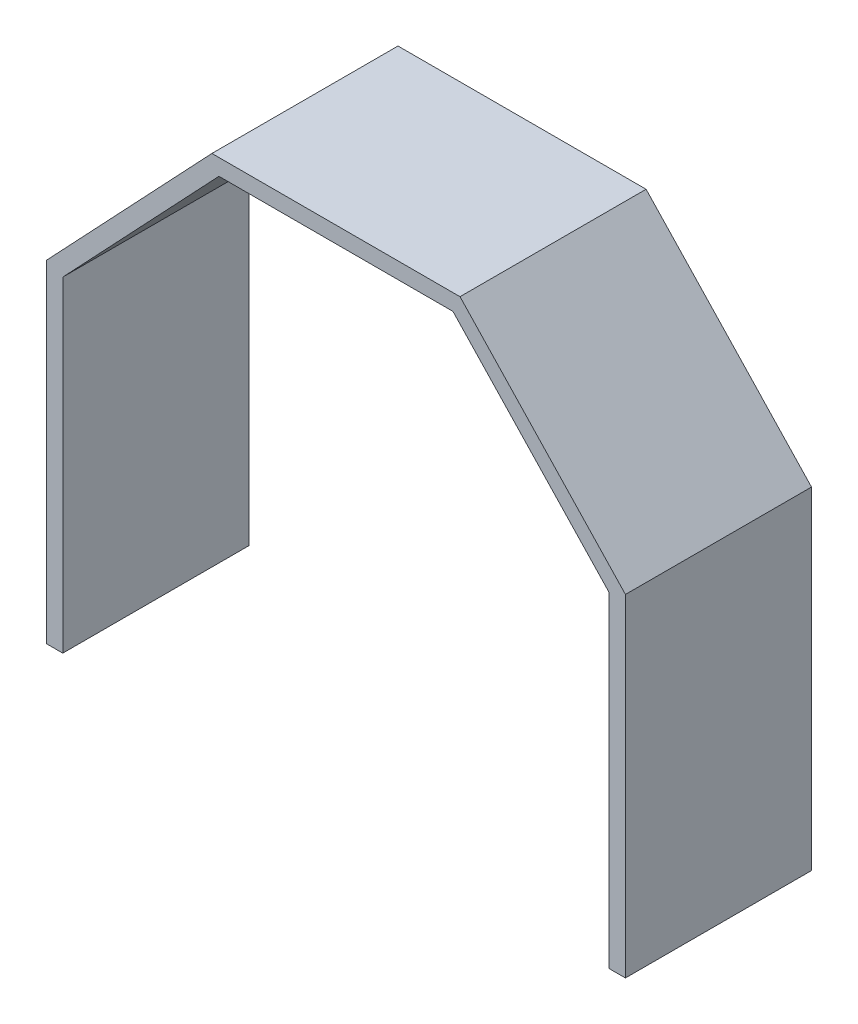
from build123d import *

# Parameters (mm, degrees)
BOSS_EXTRUDE1_DEPTH = 22.86


with BuildPart() as part:
    # Sketch1 → Boss-Extrude1 (new body)
    with BuildSketch(Plane.XY):
        Polygon((-35.56, 15.24), (-35.56, -15.24), (-35.56, -25.5651), (-33.56, -25.5651), (-33.56, 14.444969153), (-14.377777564, 34.76), (0, 34.76), (14.377777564, 34.76), (33.56, 14.444969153), (33.56, -25.5651), (35.56, -25.5651), (35.56, -15.24), (35.56, 15.24), (15.24, 36.76), (-15.24, 36.76), align=None)
    extrude(amount=BOSS_EXTRUDE1_DEPTH)


solid = part.part
